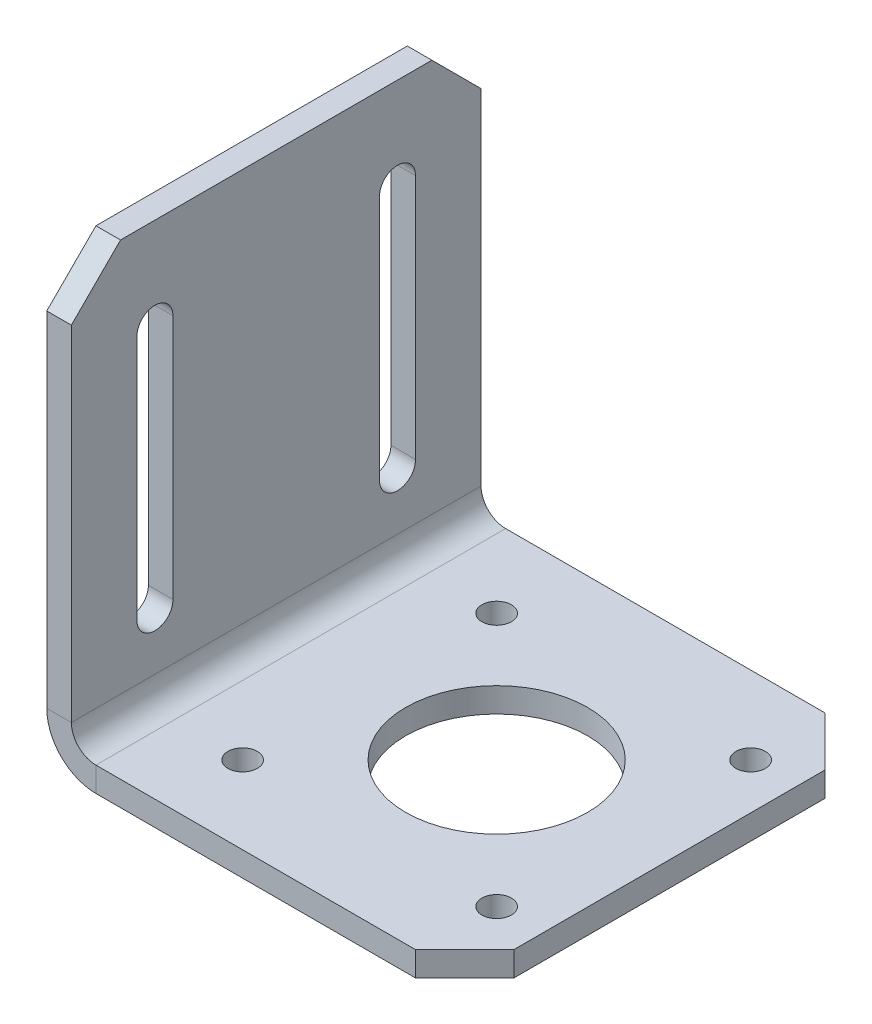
ISO-10303-21;
HEADER;
FILE_DESCRIPTION(('STEP AP214'),'2;1');
FILE_NAME('part.step','',(''),(''),'','','');
FILE_SCHEMA(('AUTOMOTIVE_DESIGN { 1 0 10303 214 1 1 1 1 }'));
ENDSEC;
DATA;
#1=APPLICATION_CONTEXT('core data for automotive mechanical design processes');
#2=APPLICATION_PROTOCOL_DEFINITION('international standard','automotive_design',2000,#1);
#3=PRODUCT_CONTEXT('',#1,'mechanical');
#4=PRODUCT('Part','Part','',(#3));
#5=PRODUCT_RELATED_PRODUCT_CATEGORY('part','',(#4));
#6=PRODUCT_DEFINITION_FORMATION('','',#4);
#7=PRODUCT_DEFINITION_CONTEXT('part definition',#1,'design');
#8=PRODUCT_DEFINITION('design','',#6,#7);
#9=PRODUCT_DEFINITION_SHAPE('','',#8);
#10=(LENGTH_UNIT() NAMED_UNIT(*) SI_UNIT(.MILLI.,.METRE.));
#11=(NAMED_UNIT(*) PLANE_ANGLE_UNIT() SI_UNIT($,.RADIAN.));
#12=(NAMED_UNIT(*) SI_UNIT($,.STERADIAN.) SOLID_ANGLE_UNIT());
#13=UNCERTAINTY_MEASURE_WITH_UNIT(LENGTH_MEASURE(1.E-05),#10,'distance_accuracy_value','');
#14=(GEOMETRIC_REPRESENTATION_CONTEXT(3) GLOBAL_UNCERTAINTY_ASSIGNED_CONTEXT((#13)) GLOBAL_UNIT_ASSIGNED_CONTEXT((#10,
#11,#12)) REPRESENTATION_CONTEXT('',''));
#15=CARTESIAN_POINT('',(0.,0.,0.));
#16=DIRECTION('',(0.,0.,1.));
#17=DIRECTION('',(1.,0.,0.));
#18=AXIS2_PLACEMENT_3D('',#15,#16,#17);
#19=CARTESIAN_POINT('',(0.,6.,50.));
#20=DIRECTION('',(0.,0.,1.));
#21=DIRECTION('',(1.,0.,0.));
#22=AXIS2_PLACEMENT_3D('',#19,#20,#21);
#23=PLANE('',#22);
#24=DIRECTION('',(1.,0.,0.));
#25=VECTOR('',#24,1.);
#26=CARTESIAN_POINT('',(0.,6.,50.));
#27=LINE('',#26,#25);
#28=CARTESIAN_POINT('',(0.,6.,50.));
#29=VERTEX_POINT('',#28);
#30=CARTESIAN_POINT('',(3.,6.,50.));
#31=VERTEX_POINT('',#30);
#32=EDGE_CURVE('E293',#29,#31,#27,.T.);
#33=ORIENTED_EDGE('',*,*,#32,.F.);
#34=CARTESIAN_POINT('',(6.,6.,50.));
#35=DIRECTION('',(0.,0.,-1.));
#36=DIRECTION('',(-1.,0.,0.));
#37=AXIS2_PLACEMENT_3D('',#34,#35,#36);
#38=CIRCLE('',#37,6.);
#39=CARTESIAN_POINT('',(6.,0.,50.));
#40=VERTEX_POINT('',#39);
#41=EDGE_CURVE('E245',#29,#40,#38,.F.);
#42=ORIENTED_EDGE('',*,*,#41,.T.);
#43=DIRECTION('',(0.,-1.,0.));
#44=VECTOR('',#43,1.);
#45=CARTESIAN_POINT('',(6.,3.,50.));
#46=LINE('',#45,#44);
#47=CARTESIAN_POINT('',(6.,3.,50.));
#48=VERTEX_POINT('',#47);
#49=EDGE_CURVE('E291',#48,#40,#46,.T.);
#50=ORIENTED_EDGE('',*,*,#49,.F.);
#51=CARTESIAN_POINT('',(6.,6.,50.));
#52=DIRECTION('',(0.,0.,1.));
#53=DIRECTION('',(1.,0.,0.));
#54=AXIS2_PLACEMENT_3D('',#51,#52,#53);
#55=CIRCLE('',#54,3.);
#56=EDGE_CURVE('E238',#31,#48,#55,.T.);
#57=ORIENTED_EDGE('',*,*,#56,.F.);
#58=EDGE_LOOP('',(#33,#42,#50,#57));
#59=FACE_BOUND('',#58,.T.);
#60=ADVANCED_FACE('F40',(#59),#23,.T.);
#61=CARTESIAN_POINT('',(6.,3.,50.));
#62=DIRECTION('',(0.,0.,1.));
#63=DIRECTION('',(1.,0.,0.));
#64=AXIS2_PLACEMENT_3D('',#61,#62,#63);
#65=PLANE('',#64);
#66=DIRECTION('',(0.,-1.,0.));
#67=VECTOR('',#66,1.);
#68=CARTESIAN_POINT('',(3.,54.,50.));
#69=LINE('',#68,#67);
#70=CARTESIAN_POINT('',(3.,48.,50.));
#71=VERTEX_POINT('',#70);
#72=EDGE_CURVE('E241',#71,#31,#69,.T.);
#73=ORIENTED_EDGE('',*,*,#72,.F.);
#74=DIRECTION('',(-1.,0.,0.));
#75=VECTOR('',#74,1.);
#76=CARTESIAN_POINT('',(6.,48.,50.));
#77=LINE('',#76,#75);
#78=CARTESIAN_POINT('',(0.,48.,50.));
#79=VERTEX_POINT('',#78);
#80=EDGE_CURVE('E330',#71,#79,#77,.T.);
#81=ORIENTED_EDGE('',*,*,#80,.T.);
#82=DIRECTION('',(0.,-1.,0.));
#83=VECTOR('',#82,1.);
#84=CARTESIAN_POINT('',(0.,54.,50.));
#85=LINE('',#84,#83);
#86=EDGE_CURVE('E243',#79,#29,#85,.T.);
#87=ORIENTED_EDGE('',*,*,#86,.T.);
#88=ORIENTED_EDGE('',*,*,#32,.T.);
#89=EDGE_LOOP('',(#73,#81,#87,#88));
#90=FACE_BOUND('',#89,.T.);
#91=ADVANCED_FACE('F368',(#90),#65,.T.);
#92=CARTESIAN_POINT('',(6.,0.,0.));
#93=DIRECTION('',(0.,0.,-1.));
#94=DIRECTION('',(-1.,0.,0.));
#95=AXIS2_PLACEMENT_3D('',#92,#93,#94);
#96=PLANE('',#95);
#97=DIRECTION('',(0.,1.,0.));
#98=VECTOR('',#97,1.);
#99=CARTESIAN_POINT('',(6.,0.,0.));
#100=LINE('',#99,#98);
#101=CARTESIAN_POINT('',(6.,0.,0.));
#102=VERTEX_POINT('',#101);
#103=CARTESIAN_POINT('',(6.,3.,0.));
#104=VERTEX_POINT('',#103);
#105=EDGE_CURVE('E289',#102,#104,#100,.T.);
#106=ORIENTED_EDGE('',*,*,#105,.F.);
#107=CARTESIAN_POINT('',(6.,6.,0.));
#108=DIRECTION('',(0.,0.,-1.));
#109=DIRECTION('',(-1.,0.,0.));
#110=AXIS2_PLACEMENT_3D('',#107,#108,#109);
#111=CIRCLE('',#110,6.);
#112=CARTESIAN_POINT('',(0.,6.,0.));
#113=VERTEX_POINT('',#112);
#114=EDGE_CURVE('E235',#113,#102,#111,.F.);
#115=ORIENTED_EDGE('',*,*,#114,.F.);
#116=DIRECTION('',(-1.,0.,0.));
#117=VECTOR('',#116,1.);
#118=CARTESIAN_POINT('',(3.,6.,0.));
#119=LINE('',#118,#117);
#120=CARTESIAN_POINT('',(3.,6.,0.));
#121=VERTEX_POINT('',#120);
#122=EDGE_CURVE('E286',#121,#113,#119,.T.);
#123=ORIENTED_EDGE('',*,*,#122,.F.);
#124=CARTESIAN_POINT('',(6.,6.,0.));
#125=DIRECTION('',(0.,0.,1.));
#126=DIRECTION('',(1.,0.,0.));
#127=AXIS2_PLACEMENT_3D('',#124,#125,#126);
#128=CIRCLE('',#127,3.);
#129=EDGE_CURVE('E254',#121,#104,#128,.T.);
#130=ORIENTED_EDGE('',*,*,#129,.T.);
#131=EDGE_LOOP('',(#106,#115,#123,#130));
#132=FACE_BOUND('',#131,.T.);
#133=ADVANCED_FACE('F375',(#132),#96,.T.);
#134=CARTESIAN_POINT('',(3.,6.,0.));
#135=DIRECTION('',(0.,0.,-1.));
#136=DIRECTION('',(-1.,0.,0.));
#137=AXIS2_PLACEMENT_3D('',#134,#135,#136);
#138=PLANE('',#137);
#139=DIRECTION('',(1.,0.,0.));
#140=VECTOR('',#139,1.);
#141=CARTESIAN_POINT('',(0.,3.,0.));
#142=LINE('',#141,#140);
#143=CARTESIAN_POINT('',(45.,3.,0.));
#144=VERTEX_POINT('',#143);
#145=EDGE_CURVE('E251',#104,#144,#142,.T.);
#146=ORIENTED_EDGE('',*,*,#145,.T.);
#147=DIRECTION('',(0.,-1.,0.));
#148=VECTOR('',#147,1.);
#149=CARTESIAN_POINT('',(45.,6.,0.));
#150=LINE('',#149,#148);
#151=CARTESIAN_POINT('',(45.,0.,0.));
#152=VERTEX_POINT('',#151);
#153=EDGE_CURVE('E312',#144,#152,#150,.T.);
#154=ORIENTED_EDGE('',*,*,#153,.T.);
#155=DIRECTION('',(1.,0.,0.));
#156=VECTOR('',#155,1.);
#157=CARTESIAN_POINT('',(0.,0.,0.));
#158=LINE('',#157,#156);
#159=EDGE_CURVE('E209',#102,#152,#158,.T.);
#160=ORIENTED_EDGE('',*,*,#159,.F.);
#161=ORIENTED_EDGE('',*,*,#105,.T.);
#162=EDGE_LOOP('',(#146,#154,#160,#161));
#163=FACE_BOUND('',#162,.T.);
#164=ADVANCED_FACE('F422',(#163),#138,.T.);
#165=CARTESIAN_POINT('',(0.,0.,50.));
#166=DIRECTION('',(0.,1.,0.));
#167=DIRECTION('',(0.,0.,1.));
#168=AXIS2_PLACEMENT_3D('',#165,#166,#167);
#169=PLANE('',#168);
#170=CARTESIAN_POINT('',(14.4,0.,40.5));
#171=DIRECTION('',(0.,1.,0.));
#172=DIRECTION('',(0.,0.,1.));
#173=AXIS2_PLACEMENT_3D('',#170,#171,#172);
#174=CIRCLE('',#173,1.8);
#175=CARTESIAN_POINT('',(14.4,0.,42.3));
#176=VERTEX_POINT('',#175);
#177=EDGE_CURVE('E214',#176,#176,#174,.T.);
#178=ORIENTED_EDGE('',*,*,#177,.T.);
#179=EDGE_LOOP('',(#178));
#180=FACE_BOUND('',#179,.T.);
#181=CARTESIAN_POINT('',(45.4,0.,40.5));
#182=DIRECTION('',(0.,1.,0.));
#183=DIRECTION('',(0.,0.,1.));
#184=AXIS2_PLACEMENT_3D('',#181,#182,#183);
#185=CIRCLE('',#184,1.8);
#186=CARTESIAN_POINT('',(45.4,0.,42.3));
#187=VERTEX_POINT('',#186);
#188=EDGE_CURVE('E751',#187,#187,#185,.T.);
#189=ORIENTED_EDGE('',*,*,#188,.T.);
#190=EDGE_LOOP('',(#189));
#191=FACE_BOUND('',#190,.T.);
#192=CARTESIAN_POINT('',(45.4,0.,9.50000000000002));
#193=DIRECTION('',(0.,1.,0.));
#194=DIRECTION('',(0.,0.,1.));
#195=AXIS2_PLACEMENT_3D('',#192,#193,#194);
#196=CIRCLE('',#195,1.8);
#197=CARTESIAN_POINT('',(45.4,0.,11.3));
#198=VERTEX_POINT('',#197);
#199=EDGE_CURVE('E754',#198,#198,#196,.T.);
#200=ORIENTED_EDGE('',*,*,#199,.T.);
#201=EDGE_LOOP('',(#200));
#202=FACE_BOUND('',#201,.T.);
#203=CARTESIAN_POINT('',(14.4,0.,9.50000000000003));
#204=DIRECTION('',(0.,1.,0.));
#205=DIRECTION('',(0.,0.,1.));
#206=AXIS2_PLACEMENT_3D('',#203,#204,#205);
#207=CIRCLE('',#206,1.8);
#208=CARTESIAN_POINT('',(14.4,0.,11.3));
#209=VERTEX_POINT('',#208);
#210=EDGE_CURVE('E759',#209,#209,#207,.T.);
#211=ORIENTED_EDGE('',*,*,#210,.T.);
#212=EDGE_LOOP('',(#211));
#213=FACE_BOUND('',#212,.T.);
#214=CARTESIAN_POINT('',(29.9,0.,25.));
#215=DIRECTION('',(0.,1.,0.));
#216=DIRECTION('',(0.,0.,1.));
#217=AXIS2_PLACEMENT_3D('',#214,#215,#216);
#218=CIRCLE('',#217,11.1);
#219=CARTESIAN_POINT('',(29.9,0.,36.1));
#220=VERTEX_POINT('',#219);
#221=EDGE_CURVE('E762',#220,#220,#218,.T.);
#222=ORIENTED_EDGE('',*,*,#221,.T.);
#223=EDGE_LOOP('',(#222));
#224=FACE_BOUND('',#223,.T.);
#225=ORIENTED_EDGE('',*,*,#159,.T.);
#226=DIRECTION('',(-0.707106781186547,0.,-0.707106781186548));
#227=VECTOR('',#226,1.);
#228=CARTESIAN_POINT('',(45.,0.,0.));
#229=LINE('',#228,#227);
#230=CARTESIAN_POINT('',(51.,0.,6.00000000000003));
#231=VERTEX_POINT('',#230);
#232=EDGE_CURVE('E317',#152,#231,#229,.F.);
#233=ORIENTED_EDGE('',*,*,#232,.T.);
#234=DIRECTION('',(0.,0.,-1.));
#235=VECTOR('',#234,1.);
#236=CARTESIAN_POINT('',(51.,0.,50.));
#237=LINE('',#236,#235);
#238=CARTESIAN_POINT('',(51.,0.,44.));
#239=VERTEX_POINT('',#238);
#240=EDGE_CURVE('E283',#239,#231,#237,.T.);
#241=ORIENTED_EDGE('',*,*,#240,.F.);
#242=DIRECTION('',(0.707106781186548,0.,-0.707106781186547));
#243=VECTOR('',#242,1.);
#244=CARTESIAN_POINT('',(51.,0.,44.));
#245=LINE('',#244,#243);
#246=CARTESIAN_POINT('',(45.,0.,50.));
#247=VERTEX_POINT('',#246);
#248=EDGE_CURVE('E315',#239,#247,#245,.F.);
#249=ORIENTED_EDGE('',*,*,#248,.T.);
#250=DIRECTION('',(1.,0.,0.));
#251=VECTOR('',#250,1.);
#252=CARTESIAN_POINT('',(0.,0.,50.));
#253=LINE('',#252,#251);
#254=EDGE_CURVE('E231',#40,#247,#253,.T.);
#255=ORIENTED_EDGE('',*,*,#254,.F.);
#256=DIRECTION('',(0.,0.,-1.));
#257=VECTOR('',#256,1.);
#258=CARTESIAN_POINT('',(6.,0.,50.));
#259=LINE('',#258,#257);
#260=EDGE_CURVE('E248',#40,#102,#259,.T.);
#261=ORIENTED_EDGE('',*,*,#260,.T.);
#262=EDGE_LOOP('',(#225,#233,#241,#249,#255,#261));
#263=FACE_BOUND('',#262,.T.);
#264=ADVANCED_FACE('F435',(#180,#191,#202,#213,#224,#263),#169,.F.);
#265=CARTESIAN_POINT('',(51.,3.,50.));
#266=DIRECTION('',(1.,0.,0.));
#267=DIRECTION('',(0.,0.,-1.));
#268=AXIS2_PLACEMENT_3D('',#265,#266,#267);
#269=PLANE('',#268);
#270=ORIENTED_EDGE('',*,*,#240,.T.);
#271=DIRECTION('',(0.,1.,0.));
#272=VECTOR('',#271,1.);
#273=CARTESIAN_POINT('',(51.,3.,6.00000000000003));
#274=LINE('',#273,#272);
#275=CARTESIAN_POINT('',(51.,3.,6.00000000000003));
#276=VERTEX_POINT('',#275);
#277=EDGE_CURVE('E322',#231,#276,#274,.T.);
#278=ORIENTED_EDGE('',*,*,#277,.T.);
#279=DIRECTION('',(0.,0.,-1.));
#280=VECTOR('',#279,1.);
#281=CARTESIAN_POINT('',(51.,3.,50.));
#282=LINE('',#281,#280);
#283=CARTESIAN_POINT('',(51.,3.,44.));
#284=VERTEX_POINT('',#283);
#285=EDGE_CURVE('E280',#284,#276,#282,.T.);
#286=ORIENTED_EDGE('',*,*,#285,.F.);
#287=DIRECTION('',(0.,-1.,0.));
#288=VECTOR('',#287,1.);
#289=CARTESIAN_POINT('',(51.,3.,44.));
#290=LINE('',#289,#288);
#291=EDGE_CURVE('E319',#284,#239,#290,.T.);
#292=ORIENTED_EDGE('',*,*,#291,.T.);
#293=EDGE_LOOP('',(#270,#278,#286,#292));
#294=FACE_BOUND('',#293,.T.);
#295=ADVANCED_FACE('F416',(#294),#269,.T.);
#296=CARTESIAN_POINT('',(0.,3.,50.));
#297=DIRECTION('',(0.,1.,0.));
#298=DIRECTION('',(0.,0.,1.));
#299=AXIS2_PLACEMENT_3D('',#296,#297,#298);
#300=PLANE('',#299);
#301=CARTESIAN_POINT('',(14.4,3.,40.5));
#302=DIRECTION('',(0.,1.,0.));
#303=DIRECTION('',(0.,0.,1.));
#304=AXIS2_PLACEMENT_3D('',#301,#302,#303);
#305=CIRCLE('',#304,1.8);
#306=CARTESIAN_POINT('',(14.4,3.,42.3));
#307=VERTEX_POINT('',#306);
#308=EDGE_CURVE('E748',#307,#307,#305,.T.);
#309=ORIENTED_EDGE('',*,*,#308,.F.);
#310=EDGE_LOOP('',(#309));
#311=FACE_BOUND('',#310,.T.);
#312=CARTESIAN_POINT('',(45.4,3.,40.5));
#313=DIRECTION('',(0.,1.,0.));
#314=DIRECTION('',(0.,0.,1.));
#315=AXIS2_PLACEMENT_3D('',#312,#313,#314);
#316=CIRCLE('',#315,1.8);
#317=CARTESIAN_POINT('',(45.4,3.,42.3));
#318=VERTEX_POINT('',#317);
#319=EDGE_CURVE('E770',#318,#318,#316,.T.);
#320=ORIENTED_EDGE('',*,*,#319,.F.);
#321=EDGE_LOOP('',(#320));
#322=FACE_BOUND('',#321,.T.);
#323=CARTESIAN_POINT('',(45.4,3.,9.50000000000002));
#324=DIRECTION('',(0.,1.,0.));
#325=DIRECTION('',(0.,0.,1.));
#326=AXIS2_PLACEMENT_3D('',#323,#324,#325);
#327=CIRCLE('',#326,1.8);
#328=CARTESIAN_POINT('',(45.4,3.,11.3));
#329=VERTEX_POINT('',#328);
#330=EDGE_CURVE('E773',#329,#329,#327,.T.);
#331=ORIENTED_EDGE('',*,*,#330,.F.);
#332=EDGE_LOOP('',(#331));
#333=FACE_BOUND('',#332,.T.);
#334=CARTESIAN_POINT('',(14.4,3.,9.50000000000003));
#335=DIRECTION('',(0.,1.,0.));
#336=DIRECTION('',(0.,0.,1.));
#337=AXIS2_PLACEMENT_3D('',#334,#335,#336);
#338=CIRCLE('',#337,1.8);
#339=CARTESIAN_POINT('',(14.4,3.,11.3));
#340=VERTEX_POINT('',#339);
#341=EDGE_CURVE('E768',#340,#340,#338,.T.);
#342=ORIENTED_EDGE('',*,*,#341,.F.);
#343=EDGE_LOOP('',(#342));
#344=FACE_BOUND('',#343,.T.);
#345=CARTESIAN_POINT('',(29.9,3.,25.));
#346=DIRECTION('',(0.,1.,0.));
#347=DIRECTION('',(0.,0.,1.));
#348=AXIS2_PLACEMENT_3D('',#345,#346,#347);
#349=CIRCLE('',#348,11.1);
#350=CARTESIAN_POINT('',(29.9,3.,36.1));
#351=VERTEX_POINT('',#350);
#352=EDGE_CURVE('E765',#351,#351,#349,.T.);
#353=ORIENTED_EDGE('',*,*,#352,.F.);
#354=EDGE_LOOP('',(#353));
#355=FACE_BOUND('',#354,.T.);
#356=ORIENTED_EDGE('',*,*,#285,.T.);
#357=DIRECTION('',(0.707106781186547,0.,0.707106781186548));
#358=VECTOR('',#357,1.);
#359=CARTESIAN_POINT('',(47.5,3.,2.50000000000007));
#360=LINE('',#359,#358);
#361=EDGE_CURVE('E326',#276,#144,#360,.F.);
#362=ORIENTED_EDGE('',*,*,#361,.T.);
#363=ORIENTED_EDGE('',*,*,#145,.F.);
#364=DIRECTION('',(0.,0.,-1.));
#365=VECTOR('',#364,1.);
#366=CARTESIAN_POINT('',(6.,3.,50.));
#367=LINE('',#366,#365);
#368=EDGE_CURVE('E277',#48,#104,#367,.T.);
#369=ORIENTED_EDGE('',*,*,#368,.F.);
#370=DIRECTION('',(1.,0.,0.));
#371=VECTOR('',#370,1.);
#372=CARTESIAN_POINT('',(0.,3.,50.));
#373=LINE('',#372,#371);
#374=CARTESIAN_POINT('',(45.,3.,50.));
#375=VERTEX_POINT('',#374);
#376=EDGE_CURVE('E234',#48,#375,#373,.T.);
#377=ORIENTED_EDGE('',*,*,#376,.T.);
#378=DIRECTION('',(-0.707106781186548,0.,0.707106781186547));
#379=VECTOR('',#378,1.);
#380=CARTESIAN_POINT('',(22.4999999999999,3.,72.5));
#381=LINE('',#380,#379);
#382=EDGE_CURVE('E324',#375,#284,#381,.F.);
#383=ORIENTED_EDGE('',*,*,#382,.T.);
#384=EDGE_LOOP('',(#356,#362,#363,#369,#377,#383));
#385=FACE_BOUND('',#384,.T.);
#386=ADVANCED_FACE('F411',(#311,#322,#333,#344,#355,#385),#300,.T.);
#387=CARTESIAN_POINT('',(6.,6.,50.));
#388=DIRECTION('',(0.,0.,-1.));
#389=DIRECTION('',(-1.,0.,0.));
#390=AXIS2_PLACEMENT_3D('',#387,#388,#389);
#391=CYLINDRICAL_SURFACE('',#390,3.);
#392=ORIENTED_EDGE('',*,*,#129,.F.);
#393=DIRECTION('',(0.,0.,-1.));
#394=VECTOR('',#393,1.);
#395=CARTESIAN_POINT('',(3.,6.,50.));
#396=LINE('',#395,#394);
#397=EDGE_CURVE('E274',#31,#121,#396,.T.);
#398=ORIENTED_EDGE('',*,*,#397,.F.);
#399=ORIENTED_EDGE('',*,*,#56,.T.);
#400=ORIENTED_EDGE('',*,*,#368,.T.);
#401=EDGE_LOOP('',(#392,#398,#399,#400));
#402=FACE_BOUND('',#401,.T.);
#403=ADVANCED_FACE('F428',(#402),#391,.F.);
#404=CARTESIAN_POINT('',(3.,54.,50.));
#405=DIRECTION('',(1.,0.,0.));
#406=DIRECTION('',(0.,1.,0.));
#407=AXIS2_PLACEMENT_3D('',#404,#405,#406);
#408=PLANE('',#407);
#409=CARTESIAN_POINT('',(3.,42.8,39.8));
#410=DIRECTION('',(1.,0.,0.));
#411=DIRECTION('',(0.,1.,0.));
#412=AXIS2_PLACEMENT_3D('',#409,#410,#411);
#413=CIRCLE('',#412,2.20000000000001);
#414=CARTESIAN_POINT('',(3.,42.8,37.6));
#415=VERTEX_POINT('',#414);
#416=CARTESIAN_POINT('',(3.,42.8,42.));
#417=VERTEX_POINT('',#416);
#418=EDGE_CURVE('E56',#415,#417,#413,.T.);
#419=ORIENTED_EDGE('',*,*,#418,.F.);
#420=DIRECTION('',(0.,1.,0.));
#421=VECTOR('',#420,1.);
#422=CARTESIAN_POINT('',(3.,42.8,37.6));
#423=LINE('',#422,#421);
#424=CARTESIAN_POINT('',(3.,12.8,37.6));
#425=VERTEX_POINT('',#424);
#426=EDGE_CURVE('E202',#425,#415,#423,.T.);
#427=ORIENTED_EDGE('',*,*,#426,.F.);
#428=CARTESIAN_POINT('',(3.,12.8,39.8));
#429=DIRECTION('',(1.,0.,0.));
#430=DIRECTION('',(0.,1.,0.));
#431=AXIS2_PLACEMENT_3D('',#428,#429,#430);
#432=CIRCLE('',#431,2.2);
#433=CARTESIAN_POINT('',(3.,12.8,42.));
#434=VERTEX_POINT('',#433);
#435=EDGE_CURVE('E185',#434,#425,#432,.T.);
#436=ORIENTED_EDGE('',*,*,#435,.F.);
#437=DIRECTION('',(0.,-1.,0.));
#438=VECTOR('',#437,1.);
#439=CARTESIAN_POINT('',(3.,42.8,42.));
#440=LINE('',#439,#438);
#441=EDGE_CURVE('E195',#417,#434,#440,.T.);
#442=ORIENTED_EDGE('',*,*,#441,.F.);
#443=EDGE_LOOP('',(#419,#427,#436,#442));
#444=FACE_BOUND('',#443,.T.);
#445=CARTESIAN_POINT('',(3.,42.8,10.2));
#446=DIRECTION('',(1.,0.,0.));
#447=DIRECTION('',(0.,-1.,0.));
#448=AXIS2_PLACEMENT_3D('',#445,#446,#447);
#449=CIRCLE('',#448,2.20000000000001);
#450=CARTESIAN_POINT('',(3.,42.8,8.00000000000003));
#451=VERTEX_POINT('',#450);
#452=CARTESIAN_POINT('',(3.,42.8,12.4));
#453=VERTEX_POINT('',#452);
#454=EDGE_CURVE('E64',#451,#453,#449,.T.);
#455=ORIENTED_EDGE('',*,*,#454,.F.);
#456=DIRECTION('',(0.,1.,0.));
#457=VECTOR('',#456,1.);
#458=CARTESIAN_POINT('',(3.,42.8,8.00000000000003));
#459=LINE('',#458,#457);
#460=CARTESIAN_POINT('',(3.,12.8,8.));
#461=VERTEX_POINT('',#460);
#462=EDGE_CURVE('E220',#461,#451,#459,.T.);
#463=ORIENTED_EDGE('',*,*,#462,.F.);
#464=CARTESIAN_POINT('',(3.,12.8,10.2));
#465=DIRECTION('',(1.,0.,0.));
#466=DIRECTION('',(0.,-1.,0.));
#467=AXIS2_PLACEMENT_3D('',#464,#465,#466);
#468=CIRCLE('',#467,2.2);
#469=CARTESIAN_POINT('',(3.,12.8,12.4));
#470=VERTEX_POINT('',#469);
#471=EDGE_CURVE('E217',#470,#461,#468,.T.);
#472=ORIENTED_EDGE('',*,*,#471,.F.);
#473=DIRECTION('',(0.,-1.,0.));
#474=VECTOR('',#473,1.);
#475=CARTESIAN_POINT('',(3.,42.8,12.4));
#476=LINE('',#475,#474);
#477=EDGE_CURVE('E213',#453,#470,#476,.T.);
#478=ORIENTED_EDGE('',*,*,#477,.F.);
#479=EDGE_LOOP('',(#455,#463,#472,#478));
#480=FACE_BOUND('',#479,.T.);
#481=DIRECTION('',(0.,-1.,0.));
#482=VECTOR('',#481,1.);
#483=CARTESIAN_POINT('',(3.,54.,0.));
#484=LINE('',#483,#482);
#485=CARTESIAN_POINT('',(3.,48.,0.));
#486=VERTEX_POINT('',#485);
#487=EDGE_CURVE('E257',#486,#121,#484,.T.);
#488=ORIENTED_EDGE('',*,*,#487,.F.);
#489=DIRECTION('',(0.,0.707106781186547,0.707106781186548));
#490=VECTOR('',#489,1.);
#491=CARTESIAN_POINT('',(3.,76.,28.0000000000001));
#492=LINE('',#491,#490);
#493=CARTESIAN_POINT('',(3.,54.,6.00000000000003));
#494=VERTEX_POINT('',#493);
#495=EDGE_CURVE('E301',#486,#494,#492,.T.);
#496=ORIENTED_EDGE('',*,*,#495,.T.);
#497=DIRECTION('',(0.,0.,-1.));
#498=VECTOR('',#497,1.);
#499=CARTESIAN_POINT('',(3.,54.,50.));
#500=LINE('',#499,#498);
#501=CARTESIAN_POINT('',(3.,54.,44.));
#502=VERTEX_POINT('',#501);
#503=EDGE_CURVE('E271',#502,#494,#500,.T.);
#504=ORIENTED_EDGE('',*,*,#503,.F.);
#505=DIRECTION('',(0.,0.707106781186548,-0.707106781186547));
#506=VECTOR('',#505,1.);
#507=CARTESIAN_POINT('',(3.,51.,47.));
#508=LINE('',#507,#506);
#509=EDGE_CURVE('E299',#502,#71,#508,.F.);
#510=ORIENTED_EDGE('',*,*,#509,.T.);
#511=ORIENTED_EDGE('',*,*,#72,.T.);
#512=ORIENTED_EDGE('',*,*,#397,.T.);
#513=EDGE_LOOP('',(#488,#496,#504,#510,#511,#512));
#514=FACE_BOUND('',#513,.T.);
#515=ADVANCED_FACE('F199',(#444,#480,#514),#408,.T.);
#516=CARTESIAN_POINT('',(0.,54.,50.));
#517=DIRECTION('',(0.,1.,0.));
#518=DIRECTION('',(0.,0.,1.));
#519=AXIS2_PLACEMENT_3D('',#516,#517,#518);
#520=PLANE('',#519);
#521=ORIENTED_EDGE('',*,*,#503,.T.);
#522=DIRECTION('',(-1.,0.,0.));
#523=VECTOR('',#522,1.);
#524=CARTESIAN_POINT('',(0.,54.,6.00000000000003));
#525=LINE('',#524,#523);
#526=CARTESIAN_POINT('',(0.,54.,6.00000000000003));
#527=VERTEX_POINT('',#526);
#528=EDGE_CURVE('E306',#494,#527,#525,.T.);
#529=ORIENTED_EDGE('',*,*,#528,.T.);
#530=DIRECTION('',(0.,0.,-1.));
#531=VECTOR('',#530,1.);
#532=CARTESIAN_POINT('',(0.,54.,50.));
#533=LINE('',#532,#531);
#534=CARTESIAN_POINT('',(0.,54.,44.));
#535=VERTEX_POINT('',#534);
#536=EDGE_CURVE('E268',#535,#527,#533,.T.);
#537=ORIENTED_EDGE('',*,*,#536,.F.);
#538=DIRECTION('',(1.,0.,0.));
#539=VECTOR('',#538,1.);
#540=CARTESIAN_POINT('',(0.,54.,44.));
#541=LINE('',#540,#539);
#542=EDGE_CURVE('E303',#535,#502,#541,.T.);
#543=ORIENTED_EDGE('',*,*,#542,.T.);
#544=EDGE_LOOP('',(#521,#529,#537,#543));
#545=FACE_BOUND('',#544,.T.);
#546=ADVANCED_FACE('F455',(#545),#520,.T.);
#547=CARTESIAN_POINT('',(0.,54.,50.));
#548=DIRECTION('',(1.,0.,0.));
#549=DIRECTION('',(0.,1.,0.));
#550=AXIS2_PLACEMENT_3D('',#547,#548,#549);
#551=PLANE('',#550);
#552=DIRECTION('',(0.,1.,0.));
#553=VECTOR('',#552,1.);
#554=CARTESIAN_POINT('',(0.,54.,37.6));
#555=LINE('',#554,#553);
#556=CARTESIAN_POINT('',(0.,12.8,37.6));
#557=VERTEX_POINT('',#556);
#558=CARTESIAN_POINT('',(0.,42.8,37.6));
#559=VERTEX_POINT('',#558);
#560=EDGE_CURVE('E49',#557,#559,#555,.T.);
#561=ORIENTED_EDGE('',*,*,#560,.T.);
#562=CARTESIAN_POINT('',(0.,42.8,39.8));
#563=DIRECTION('',(1.,0.,0.));
#564=DIRECTION('',(0.,1.,0.));
#565=AXIS2_PLACEMENT_3D('',#562,#563,#564);
#566=CIRCLE('',#565,2.20000000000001);
#567=CARTESIAN_POINT('',(0.,42.8,42.));
#568=VERTEX_POINT('',#567);
#569=EDGE_CURVE('E11',#559,#568,#566,.T.);
#570=ORIENTED_EDGE('',*,*,#569,.T.);
#571=DIRECTION('',(0.,-1.,0.));
#572=VECTOR('',#571,1.);
#573=CARTESIAN_POINT('',(0.,54.,42.));
#574=LINE('',#573,#572);
#575=CARTESIAN_POINT('',(0.,12.8,42.));
#576=VERTEX_POINT('',#575);
#577=EDGE_CURVE('E344',#568,#576,#574,.T.);
#578=ORIENTED_EDGE('',*,*,#577,.T.);
#579=CARTESIAN_POINT('',(0.,12.8,39.8));
#580=DIRECTION('',(1.,0.,0.));
#581=DIRECTION('',(0.,1.,0.));
#582=AXIS2_PLACEMENT_3D('',#579,#580,#581);
#583=CIRCLE('',#582,2.2);
#584=EDGE_CURVE('E188',#576,#557,#583,.T.);
#585=ORIENTED_EDGE('',*,*,#584,.T.);
#586=EDGE_LOOP('',(#561,#570,#578,#585));
#587=FACE_BOUND('',#586,.T.);
#588=DIRECTION('',(0.,1.,0.));
#589=VECTOR('',#588,1.);
#590=CARTESIAN_POINT('',(0.,54.,8.00000000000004));
#591=LINE('',#590,#589);
#592=CARTESIAN_POINT('',(0.,12.8,8.));
#593=VERTEX_POINT('',#592);
#594=CARTESIAN_POINT('',(0.,42.8,8.00000000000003));
#595=VERTEX_POINT('',#594);
#596=EDGE_CURVE('E338',#593,#595,#591,.T.);
#597=ORIENTED_EDGE('',*,*,#596,.T.);
#598=CARTESIAN_POINT('',(0.,42.8,10.2));
#599=DIRECTION('',(1.,0.,0.));
#600=DIRECTION('',(0.,1.,0.));
#601=AXIS2_PLACEMENT_3D('',#598,#599,#600);
#602=CIRCLE('',#601,2.20000000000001);
#603=CARTESIAN_POINT('',(0.,42.8,12.4));
#604=VERTEX_POINT('',#603);
#605=EDGE_CURVE('E341',#595,#604,#602,.T.);
#606=ORIENTED_EDGE('',*,*,#605,.T.);
#607=DIRECTION('',(0.,-1.,0.));
#608=VECTOR('',#607,1.);
#609=CARTESIAN_POINT('',(0.,54.,12.4));
#610=LINE('',#609,#608);
#611=CARTESIAN_POINT('',(0.,12.8,12.4));
#612=VERTEX_POINT('',#611);
#613=EDGE_CURVE('E332',#604,#612,#610,.T.);
#614=ORIENTED_EDGE('',*,*,#613,.T.);
#615=CARTESIAN_POINT('',(0.,12.8,10.2));
#616=DIRECTION('',(1.,0.,0.));
#617=DIRECTION('',(0.,1.,0.));
#618=AXIS2_PLACEMENT_3D('',#615,#616,#617);
#619=CIRCLE('',#618,2.2);
#620=EDGE_CURVE('E335',#612,#593,#619,.T.);
#621=ORIENTED_EDGE('',*,*,#620,.T.);
#622=EDGE_LOOP('',(#597,#606,#614,#621));
#623=FACE_BOUND('',#622,.T.);
#624=ORIENTED_EDGE('',*,*,#536,.T.);
#625=DIRECTION('',(0.,-0.707106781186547,-0.707106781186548));
#626=VECTOR('',#625,1.);
#627=CARTESIAN_POINT('',(0.,48.,0.));
#628=LINE('',#627,#626);
#629=CARTESIAN_POINT('',(0.,48.,0.));
#630=VERTEX_POINT('',#629);
#631=EDGE_CURVE('E310',#527,#630,#628,.T.);
#632=ORIENTED_EDGE('',*,*,#631,.T.);
#633=DIRECTION('',(0.,-1.,0.));
#634=VECTOR('',#633,1.);
#635=CARTESIAN_POINT('',(0.,54.,0.));
#636=LINE('',#635,#634);
#637=EDGE_CURVE('E259',#630,#113,#636,.T.);
#638=ORIENTED_EDGE('',*,*,#637,.T.);
#639=DIRECTION('',(0.,0.,-1.));
#640=VECTOR('',#639,1.);
#641=CARTESIAN_POINT('',(0.,6.,50.));
#642=LINE('',#641,#640);
#643=EDGE_CURVE('E265',#29,#113,#642,.T.);
#644=ORIENTED_EDGE('',*,*,#643,.F.);
#645=ORIENTED_EDGE('',*,*,#86,.F.);
#646=DIRECTION('',(0.,-0.707106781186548,0.707106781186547));
#647=VECTOR('',#646,1.);
#648=CARTESIAN_POINT('',(0.,54.,44.));
#649=LINE('',#648,#647);
#650=EDGE_CURVE('E308',#79,#535,#649,.F.);
#651=ORIENTED_EDGE('',*,*,#650,.T.);
#652=EDGE_LOOP('',(#624,#632,#638,#644,#645,#651));
#653=FACE_BOUND('',#652,.T.);
#654=ADVANCED_FACE('F348',(#587,#623,#653),#551,.F.);
#655=CARTESIAN_POINT('',(6.,6.,50.));
#656=DIRECTION('',(0.,0.,-1.));
#657=DIRECTION('',(-1.,0.,0.));
#658=AXIS2_PLACEMENT_3D('',#655,#656,#657);
#659=CYLINDRICAL_SURFACE('',#658,6.);
#660=ORIENTED_EDGE('',*,*,#114,.T.);
#661=ORIENTED_EDGE('',*,*,#260,.F.);
#662=ORIENTED_EDGE('',*,*,#41,.F.);
#663=ORIENTED_EDGE('',*,*,#643,.T.);
#664=EDGE_LOOP('',(#660,#661,#662,#663));
#665=FACE_BOUND('',#664,.T.);
#666=ADVANCED_FACE('F439',(#665),#659,.T.);
#667=CARTESIAN_POINT('',(6.,6.,50.));
#668=DIRECTION('',(0.,0.,1.));
#669=DIRECTION('',(1.,0.,0.));
#670=AXIS2_PLACEMENT_3D('',#667,#668,#669);
#671=PLANE('',#670);
#672=ORIENTED_EDGE('',*,*,#254,.T.);
#673=DIRECTION('',(0.,1.,0.));
#674=VECTOR('',#673,1.);
#675=CARTESIAN_POINT('',(45.,6.,50.));
#676=LINE('',#675,#674);
#677=EDGE_CURVE('E328',#247,#375,#676,.T.);
#678=ORIENTED_EDGE('',*,*,#677,.T.);
#679=ORIENTED_EDGE('',*,*,#376,.F.);
#680=ORIENTED_EDGE('',*,*,#49,.T.);
#681=EDGE_LOOP('',(#672,#678,#679,#680));
#682=FACE_BOUND('',#681,.T.);
#683=ADVANCED_FACE('F432',(#682),#671,.T.);
#684=CARTESIAN_POINT('',(6.,6.,0.));
#685=DIRECTION('',(0.,0.,1.));
#686=DIRECTION('',(1.,0.,0.));
#687=AXIS2_PLACEMENT_3D('',#684,#685,#686);
#688=PLANE('',#687);
#689=ORIENTED_EDGE('',*,*,#637,.F.);
#690=DIRECTION('',(1.,0.,0.));
#691=VECTOR('',#690,1.);
#692=CARTESIAN_POINT('',(3.,48.,0.));
#693=LINE('',#692,#691);
#694=EDGE_CURVE('E296',#630,#486,#693,.T.);
#695=ORIENTED_EDGE('',*,*,#694,.T.);
#696=ORIENTED_EDGE('',*,*,#487,.T.);
#697=ORIENTED_EDGE('',*,*,#122,.T.);
#698=EDGE_LOOP('',(#689,#695,#696,#697));
#699=FACE_BOUND('',#698,.T.);
#700=ADVANCED_FACE('F389',(#699),#688,.F.);
#701=CARTESIAN_POINT('',(6.,48.,0.));
#702=DIRECTION('',(0.,0.707106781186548,-0.707106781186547));
#703=DIRECTION('',(-1.,0.,0.));
#704=AXIS2_PLACEMENT_3D('',#701,#702,#703);
#705=PLANE('',#704);
#706=ORIENTED_EDGE('',*,*,#631,.F.);
#707=ORIENTED_EDGE('',*,*,#528,.F.);
#708=ORIENTED_EDGE('',*,*,#495,.F.);
#709=ORIENTED_EDGE('',*,*,#694,.F.);
#710=EDGE_LOOP('',(#706,#707,#708,#709));
#711=FACE_BOUND('',#710,.T.);
#712=ADVANCED_FACE('F382',(#711),#705,.T.);
#713=CARTESIAN_POINT('',(45.,6.,0.));
#714=DIRECTION('',(-0.707106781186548,0.,0.707106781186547));
#715=DIRECTION('',(0.,-1.,0.));
#716=AXIS2_PLACEMENT_3D('',#713,#714,#715);
#717=PLANE('',#716);
#718=ORIENTED_EDGE('',*,*,#361,.F.);
#719=ORIENTED_EDGE('',*,*,#277,.F.);
#720=ORIENTED_EDGE('',*,*,#232,.F.);
#721=ORIENTED_EDGE('',*,*,#153,.F.);
#722=EDGE_LOOP('',(#718,#719,#720,#721));
#723=FACE_BOUND('',#722,.T.);
#724=ADVANCED_FACE('F388',(#723),#717,.F.);
#725=CARTESIAN_POINT('',(51.,3.,44.));
#726=DIRECTION('',(-0.707106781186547,0.,-0.707106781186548));
#727=DIRECTION('',(0.,-1.,0.));
#728=AXIS2_PLACEMENT_3D('',#725,#726,#727);
#729=PLANE('',#728);
#730=ORIENTED_EDGE('',*,*,#382,.F.);
#731=ORIENTED_EDGE('',*,*,#677,.F.);
#732=ORIENTED_EDGE('',*,*,#248,.F.);
#733=ORIENTED_EDGE('',*,*,#291,.F.);
#734=EDGE_LOOP('',(#730,#731,#732,#733));
#735=FACE_BOUND('',#734,.T.);
#736=ADVANCED_FACE('F395',(#735),#729,.F.);
#737=CARTESIAN_POINT('',(0.,54.,44.));
#738=DIRECTION('',(0.,-0.707106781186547,-0.707106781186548));
#739=DIRECTION('',(1.,0.,0.));
#740=AXIS2_PLACEMENT_3D('',#737,#738,#739);
#741=PLANE('',#740);
#742=ORIENTED_EDGE('',*,*,#650,.F.);
#743=ORIENTED_EDGE('',*,*,#80,.F.);
#744=ORIENTED_EDGE('',*,*,#509,.F.);
#745=ORIENTED_EDGE('',*,*,#542,.F.);
#746=EDGE_LOOP('',(#742,#743,#744,#745));
#747=FACE_BOUND('',#746,.T.);
#748=ADVANCED_FACE('F43',(#747),#741,.F.);
#749=CARTESIAN_POINT('',(-7.,42.8,10.2));
#750=DIRECTION('',(1.,0.,0.));
#751=DIRECTION('',(0.,1.,0.));
#752=AXIS2_PLACEMENT_3D('',#749,#750,#751);
#753=CYLINDRICAL_SURFACE('',#752,2.20000000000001);
#754=DIRECTION('',(1.,0.,0.));
#755=VECTOR('',#754,1.);
#756=CARTESIAN_POINT('',(-7.,42.8,8.00000000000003));
#757=LINE('',#756,#755);
#758=EDGE_CURVE('E224',#595,#451,#757,.T.);
#759=ORIENTED_EDGE('',*,*,#758,.T.);
#760=ORIENTED_EDGE('',*,*,#454,.T.);
#761=DIRECTION('',(1.,0.,0.));
#762=VECTOR('',#761,1.);
#763=CARTESIAN_POINT('',(-7.,42.8,12.4));
#764=LINE('',#763,#762);
#765=EDGE_CURVE('E223',#604,#453,#764,.T.);
#766=ORIENTED_EDGE('',*,*,#765,.F.);
#767=ORIENTED_EDGE('',*,*,#605,.F.);
#768=EDGE_LOOP('',(#759,#760,#766,#767));
#769=FACE_BOUND('',#768,.T.);
#770=ADVANCED_FACE('F404',(#769),#753,.F.);
#771=CARTESIAN_POINT('',(-7.,42.8,8.00000000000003));
#772=DIRECTION('',(0.,0.,-1.));
#773=DIRECTION('',(0.,1.,0.));
#774=AXIS2_PLACEMENT_3D('',#771,#772,#773);
#775=PLANE('',#774);
#776=DIRECTION('',(1.,0.,0.));
#777=VECTOR('',#776,1.);
#778=CARTESIAN_POINT('',(-7.,12.8,8.));
#779=LINE('',#778,#777);
#780=EDGE_CURVE('E226',#593,#461,#779,.T.);
#781=ORIENTED_EDGE('',*,*,#780,.T.);
#782=ORIENTED_EDGE('',*,*,#462,.T.);
#783=ORIENTED_EDGE('',*,*,#758,.F.);
#784=ORIENTED_EDGE('',*,*,#596,.F.);
#785=EDGE_LOOP('',(#781,#782,#783,#784));
#786=FACE_BOUND('',#785,.T.);
#787=ADVANCED_FACE('F588',(#786),#775,.F.);
#788=CARTESIAN_POINT('',(-7.,12.8,10.2));
#789=DIRECTION('',(1.,0.,0.));
#790=DIRECTION('',(0.,1.,0.));
#791=AXIS2_PLACEMENT_3D('',#788,#789,#790);
#792=CYLINDRICAL_SURFACE('',#791,2.2);
#793=DIRECTION('',(1.,0.,0.));
#794=VECTOR('',#793,1.);
#795=CARTESIAN_POINT('',(-7.,12.8,12.4));
#796=LINE('',#795,#794);
#797=EDGE_CURVE('E228',#612,#470,#796,.T.);
#798=ORIENTED_EDGE('',*,*,#797,.T.);
#799=ORIENTED_EDGE('',*,*,#471,.T.);
#800=ORIENTED_EDGE('',*,*,#780,.F.);
#801=ORIENTED_EDGE('',*,*,#620,.F.);
#802=EDGE_LOOP('',(#798,#799,#800,#801));
#803=FACE_BOUND('',#802,.T.);
#804=ADVANCED_FACE('F362',(#803),#792,.F.);
#805=CARTESIAN_POINT('',(-7.,42.8,12.4));
#806=DIRECTION('',(0.,0.,1.));
#807=DIRECTION('',(0.,-1.,0.));
#808=AXIS2_PLACEMENT_3D('',#805,#806,#807);
#809=PLANE('',#808);
#810=ORIENTED_EDGE('',*,*,#765,.T.);
#811=ORIENTED_EDGE('',*,*,#477,.T.);
#812=ORIENTED_EDGE('',*,*,#797,.F.);
#813=ORIENTED_EDGE('',*,*,#613,.F.);
#814=EDGE_LOOP('',(#810,#811,#812,#813));
#815=FACE_BOUND('',#814,.T.);
#816=ADVANCED_FACE('F355',(#815),#809,.F.);
#817=CARTESIAN_POINT('',(-7.,42.8,39.8));
#818=DIRECTION('',(1.,0.,0.));
#819=DIRECTION('',(0.,1.,0.));
#820=AXIS2_PLACEMENT_3D('',#817,#818,#819);
#821=CYLINDRICAL_SURFACE('',#820,2.20000000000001);
#822=DIRECTION('',(1.,0.,0.));
#823=VECTOR('',#822,1.);
#824=CARTESIAN_POINT('',(-7.,42.8,37.6));
#825=LINE('',#824,#823);
#826=EDGE_CURVE('E207',#559,#415,#825,.T.);
#827=ORIENTED_EDGE('',*,*,#826,.T.);
#828=ORIENTED_EDGE('',*,*,#418,.T.);
#829=DIRECTION('',(1.,0.,0.));
#830=VECTOR('',#829,1.);
#831=CARTESIAN_POINT('',(-7.,42.8,42.));
#832=LINE('',#831,#830);
#833=EDGE_CURVE('E192',#568,#417,#832,.T.);
#834=ORIENTED_EDGE('',*,*,#833,.F.);
#835=ORIENTED_EDGE('',*,*,#569,.F.);
#836=EDGE_LOOP('',(#827,#828,#834,#835));
#837=FACE_BOUND('',#836,.T.);
#838=ADVANCED_FACE('F353',(#837),#821,.F.);
#839=CARTESIAN_POINT('',(-7.,42.8,37.6));
#840=DIRECTION('',(0.,0.,-1.));
#841=DIRECTION('',(-1.,0.,0.));
#842=AXIS2_PLACEMENT_3D('',#839,#840,#841);
#843=PLANE('',#842);
#844=DIRECTION('',(1.,0.,0.));
#845=VECTOR('',#844,1.);
#846=CARTESIAN_POINT('',(-7.,12.8,37.6));
#847=LINE('',#846,#845);
#848=EDGE_CURVE('E191',#557,#425,#847,.T.);
#849=ORIENTED_EDGE('',*,*,#848,.T.);
#850=ORIENTED_EDGE('',*,*,#426,.T.);
#851=ORIENTED_EDGE('',*,*,#826,.F.);
#852=ORIENTED_EDGE('',*,*,#560,.F.);
#853=EDGE_LOOP('',(#849,#850,#851,#852));
#854=FACE_BOUND('',#853,.T.);
#855=ADVANCED_FACE('F352',(#854),#843,.F.);
#856=CARTESIAN_POINT('',(-7.,12.8,39.8));
#857=DIRECTION('',(1.,0.,0.));
#858=DIRECTION('',(0.,1.,0.));
#859=AXIS2_PLACEMENT_3D('',#856,#857,#858);
#860=CYLINDRICAL_SURFACE('',#859,2.2);
#861=DIRECTION('',(1.,0.,0.));
#862=VECTOR('',#861,1.);
#863=CARTESIAN_POINT('',(-7.,12.8,42.));
#864=LINE('',#863,#862);
#865=EDGE_CURVE('E180',#576,#434,#864,.T.);
#866=ORIENTED_EDGE('',*,*,#865,.T.);
#867=ORIENTED_EDGE('',*,*,#435,.T.);
#868=ORIENTED_EDGE('',*,*,#848,.F.);
#869=ORIENTED_EDGE('',*,*,#584,.F.);
#870=EDGE_LOOP('',(#866,#867,#868,#869));
#871=FACE_BOUND('',#870,.T.);
#872=ADVANCED_FACE('F182',(#871),#860,.F.);
#873=CARTESIAN_POINT('',(-7.,42.8,42.));
#874=DIRECTION('',(0.,0.,1.));
#875=DIRECTION('',(0.,-1.,0.));
#876=AXIS2_PLACEMENT_3D('',#873,#874,#875);
#877=PLANE('',#876);
#878=ORIENTED_EDGE('',*,*,#833,.T.);
#879=ORIENTED_EDGE('',*,*,#441,.T.);
#880=ORIENTED_EDGE('',*,*,#865,.F.);
#881=ORIENTED_EDGE('',*,*,#577,.F.);
#882=EDGE_LOOP('',(#878,#879,#880,#881));
#883=FACE_BOUND('',#882,.T.);
#884=ADVANCED_FACE('F196',(#883),#877,.F.);
#885=CARTESIAN_POINT('',(29.9,-7.,25.));
#886=DIRECTION('',(0.,1.,0.));
#887=DIRECTION('',(0.,0.,1.));
#888=AXIS2_PLACEMENT_3D('',#885,#886,#887);
#889=CYLINDRICAL_SURFACE('',#888,11.1);
#890=ORIENTED_EDGE('',*,*,#352,.T.);
#891=EDGE_LOOP('',(#890));
#892=FACE_BOUND('',#891,.T.);
#893=ORIENTED_EDGE('',*,*,#221,.F.);
#894=EDGE_LOOP('',(#893));
#895=FACE_BOUND('',#894,.T.);
#896=ADVANCED_FACE('F634',(#892,#895),#889,.F.);
#897=CARTESIAN_POINT('',(14.4,-7.,9.50000000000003));
#898=DIRECTION('',(0.,1.,0.));
#899=DIRECTION('',(0.,0.,1.));
#900=AXIS2_PLACEMENT_3D('',#897,#898,#899);
#901=CYLINDRICAL_SURFACE('',#900,1.8);
#902=ORIENTED_EDGE('',*,*,#341,.T.);
#903=EDGE_LOOP('',(#902));
#904=FACE_BOUND('',#903,.T.);
#905=ORIENTED_EDGE('',*,*,#210,.F.);
#906=EDGE_LOOP('',(#905));
#907=FACE_BOUND('',#906,.T.);
#908=ADVANCED_FACE('F643',(#904,#907),#901,.F.);
#909=CARTESIAN_POINT('',(45.4,-7.,9.50000000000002));
#910=DIRECTION('',(0.,1.,0.));
#911=DIRECTION('',(0.,0.,1.));
#912=AXIS2_PLACEMENT_3D('',#909,#910,#911);
#913=CYLINDRICAL_SURFACE('',#912,1.8);
#914=ORIENTED_EDGE('',*,*,#330,.T.);
#915=EDGE_LOOP('',(#914));
#916=FACE_BOUND('',#915,.T.);
#917=ORIENTED_EDGE('',*,*,#199,.F.);
#918=EDGE_LOOP('',(#917));
#919=FACE_BOUND('',#918,.T.);
#920=ADVANCED_FACE('F650',(#916,#919),#913,.F.);
#921=CARTESIAN_POINT('',(45.4,-7.,40.5));
#922=DIRECTION('',(0.,1.,0.));
#923=DIRECTION('',(0.,0.,1.));
#924=AXIS2_PLACEMENT_3D('',#921,#922,#923);
#925=CYLINDRICAL_SURFACE('',#924,1.8);
#926=ORIENTED_EDGE('',*,*,#319,.T.);
#927=EDGE_LOOP('',(#926));
#928=FACE_BOUND('',#927,.T.);
#929=ORIENTED_EDGE('',*,*,#188,.F.);
#930=EDGE_LOOP('',(#929));
#931=FACE_BOUND('',#930,.T.);
#932=ADVANCED_FACE('F658',(#928,#931),#925,.F.);
#933=CARTESIAN_POINT('',(14.4,-7.,40.5));
#934=DIRECTION('',(0.,1.,0.));
#935=DIRECTION('',(0.,0.,1.));
#936=AXIS2_PLACEMENT_3D('',#933,#934,#935);
#937=CYLINDRICAL_SURFACE('',#936,1.8);
#938=ORIENTED_EDGE('',*,*,#308,.T.);
#939=EDGE_LOOP('',(#938));
#940=FACE_BOUND('',#939,.T.);
#941=ORIENTED_EDGE('',*,*,#177,.F.);
#942=EDGE_LOOP('',(#941));
#943=FACE_BOUND('',#942,.T.);
#944=ADVANCED_FACE('F666',(#940,#943),#937,.F.);
#945=CLOSED_SHELL('',(#60,#91,#133,#164,#264,#295,#386,#403,#515,#546,#654,#666,#683,#700,#712,
#724,#736,#748,#770,#787,#804,#816,#838,#855,#872,#884,#896,#908,#920,#932,#944));
#946=MANIFOLD_SOLID_BREP('B2',#945);
#947=ADVANCED_BREP_SHAPE_REPRESENTATION('',(#18,#946),#14);
#948=SHAPE_DEFINITION_REPRESENTATION(#9,#947);
ENDSEC;
END-ISO-10303-21;
